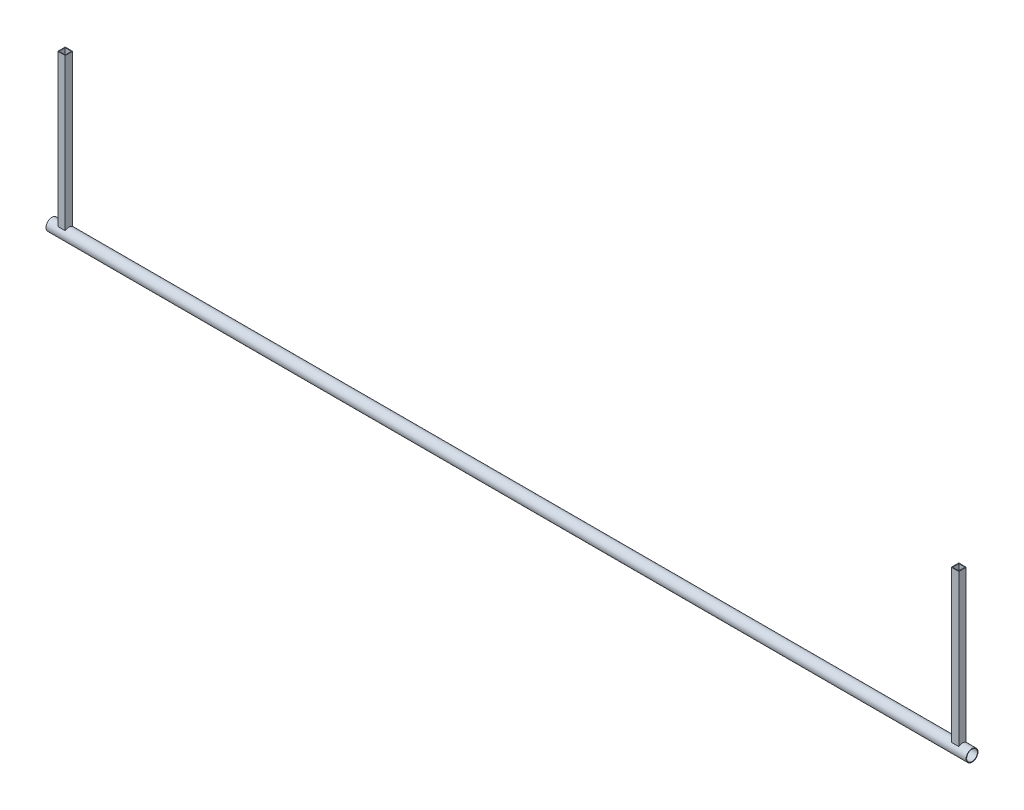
ISO-10303-21;
HEADER;
FILE_DESCRIPTION(('STEP AP214'),'2;1');
FILE_NAME('part.step','',(''),(''),'','','');
FILE_SCHEMA(('AUTOMOTIVE_DESIGN { 1 0 10303 214 1 1 1 1 }'));
ENDSEC;
DATA;
#1=APPLICATION_CONTEXT('core data for automotive mechanical design processes');
#2=APPLICATION_PROTOCOL_DEFINITION('international standard','automotive_design',2000,#1);
#3=PRODUCT_CONTEXT('',#1,'mechanical');
#4=PRODUCT('Part','Part','',(#3));
#5=PRODUCT_RELATED_PRODUCT_CATEGORY('part','',(#4));
#6=PRODUCT_DEFINITION_FORMATION('','',#4);
#7=PRODUCT_DEFINITION_CONTEXT('part definition',#1,'design');
#8=PRODUCT_DEFINITION('design','',#6,#7);
#9=PRODUCT_DEFINITION_SHAPE('','',#8);
#10=(LENGTH_UNIT() NAMED_UNIT(*) SI_UNIT(.MILLI.,.METRE.));
#11=(NAMED_UNIT(*) PLANE_ANGLE_UNIT() SI_UNIT($,.RADIAN.));
#12=(NAMED_UNIT(*) SI_UNIT($,.STERADIAN.) SOLID_ANGLE_UNIT());
#13=UNCERTAINTY_MEASURE_WITH_UNIT(LENGTH_MEASURE(1.E-05),#10,'distance_accuracy_value','');
#14=(GEOMETRIC_REPRESENTATION_CONTEXT(3) GLOBAL_UNCERTAINTY_ASSIGNED_CONTEXT((#13)) GLOBAL_UNIT_ASSIGNED_CONTEXT((#10,
#11,#12)) REPRESENTATION_CONTEXT('',''));
#15=CARTESIAN_POINT('',(0.,0.,0.));
#16=DIRECTION('',(0.,0.,1.));
#17=DIRECTION('',(1.,0.,0.));
#18=AXIS2_PLACEMENT_3D('',#15,#16,#17);
#19=CARTESIAN_POINT('',(3090.,0.,0.));
#20=DIRECTION('',(-1.,0.,0.));
#21=DIRECTION('',(0.,0.,1.));
#22=AXIS2_PLACEMENT_3D('',#19,#20,#21);
#23=CYLINDRICAL_SURFACE('',#22,20.);
#24=CARTESIAN_POINT('',(3090.,0.,0.));
#25=DIRECTION('',(1.,0.,0.));
#26=DIRECTION('',(0.,0.,-1.));
#27=AXIS2_PLACEMENT_3D('',#24,#25,#26);
#28=CIRCLE('',#27,20.);
#29=CARTESIAN_POINT('',(3090.,0.,-20.));
#30=VERTEX_POINT('',#29);
#31=EDGE_CURVE('E241',#30,#30,#28,.T.);
#32=ORIENTED_EDGE('',*,*,#31,.F.);
#33=EDGE_LOOP('',(#32));
#34=FACE_BOUND('',#33,.T.);
#35=CARTESIAN_POINT('',(0.,0.,0.));
#36=DIRECTION('',(1.,0.,0.));
#37=DIRECTION('',(0.,0.,-1.));
#38=AXIS2_PLACEMENT_3D('',#35,#36,#37);
#39=CIRCLE('',#38,20.);
#40=CARTESIAN_POINT('',(0.,0.,-20.));
#41=VERTEX_POINT('',#40);
#42=EDGE_CURVE('E240',#41,#41,#39,.T.);
#43=ORIENTED_EDGE('',*,*,#42,.T.);
#44=EDGE_LOOP('',(#43));
#45=FACE_BOUND('',#44,.T.);
#46=CARTESIAN_POINT('',(32.,0.,0.));
#47=DIRECTION('',(1.,0.,0.));
#48=DIRECTION('',(0.,0.,-1.));
#49=AXIS2_PLACEMENT_3D('',#46,#47,#48);
#50=CIRCLE('',#49,20.);
#51=CARTESIAN_POINT('',(32.,15.612494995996,-12.5));
#52=VERTEX_POINT('',#51);
#53=CARTESIAN_POINT('',(32.,15.6124949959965,12.4999999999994));
#54=VERTEX_POINT('',#53);
#55=EDGE_CURVE('E267',#52,#54,#50,.T.);
#56=ORIENTED_EDGE('',*,*,#55,.F.);
#57=DIRECTION('',(-1.,0.,0.));
#58=VECTOR('',#57,1.);
#59=CARTESIAN_POINT('',(3090.,15.612494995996,-12.5));
#60=LINE('',#59,#58);
#61=CARTESIAN_POINT('',(56.9999999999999,15.612494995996,-12.5));
#62=VERTEX_POINT('',#61);
#63=EDGE_CURVE('E258',#62,#52,#60,.T.);
#64=ORIENTED_EDGE('',*,*,#63,.F.);
#65=CARTESIAN_POINT('',(56.9999999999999,0.,0.));
#66=DIRECTION('',(-1.,0.,0.));
#67=DIRECTION('',(0.,0.,1.));
#68=AXIS2_PLACEMENT_3D('',#65,#66,#67);
#69=CIRCLE('',#68,20.);
#70=CARTESIAN_POINT('',(56.9999999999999,15.612494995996,12.5));
#71=VERTEX_POINT('',#70);
#72=EDGE_CURVE('E261',#71,#62,#69,.T.);
#73=ORIENTED_EDGE('',*,*,#72,.F.);
#74=DIRECTION('',(-1.,0.,0.));
#75=VECTOR('',#74,1.);
#76=CARTESIAN_POINT('',(3090.,15.6124949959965,12.4999999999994));
#77=LINE('',#76,#75);
#78=EDGE_CURVE('E264',#54,#71,#77,.F.);
#79=ORIENTED_EDGE('',*,*,#78,.F.);
#80=EDGE_LOOP('',(#56,#64,#73,#79));
#81=FACE_BOUND('',#80,.T.);
#82=CARTESIAN_POINT('',(3058.,0.,0.));
#83=DIRECTION('',(-1.,0.,0.));
#84=DIRECTION('',(0.,0.,1.));
#85=AXIS2_PLACEMENT_3D('',#82,#83,#84);
#86=CIRCLE('',#85,20.);
#87=CARTESIAN_POINT('',(3058.,15.6124949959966,12.4999999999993));
#88=VERTEX_POINT('',#87);
#89=CARTESIAN_POINT('',(3058.,15.6124949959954,-12.5000000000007));
#90=VERTEX_POINT('',#89);
#91=EDGE_CURVE('E11',#88,#90,#86,.T.);
#92=ORIENTED_EDGE('',*,*,#91,.F.);
#93=DIRECTION('',(-1.,0.,0.));
#94=VECTOR('',#93,1.);
#95=CARTESIAN_POINT('',(3090.,15.6124949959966,12.4999999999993));
#96=LINE('',#95,#94);
#97=CARTESIAN_POINT('',(3033.,15.6124949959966,12.4999999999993));
#98=VERTEX_POINT('',#97);
#99=EDGE_CURVE('E279',#98,#88,#96,.F.);
#100=ORIENTED_EDGE('',*,*,#99,.F.);
#101=CARTESIAN_POINT('',(3033.,0.,0.));
#102=DIRECTION('',(1.,0.,0.));
#103=DIRECTION('',(0.,0.,-1.));
#104=AXIS2_PLACEMENT_3D('',#101,#102,#103);
#105=CIRCLE('',#104,20.);
#106=CARTESIAN_POINT('',(3033.,15.6124949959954,-12.5000000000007));
#107=VERTEX_POINT('',#106);
#108=EDGE_CURVE('E50',#107,#98,#105,.T.);
#109=ORIENTED_EDGE('',*,*,#108,.F.);
#110=DIRECTION('',(-1.,0.,0.));
#111=VECTOR('',#110,1.);
#112=CARTESIAN_POINT('',(3090.,15.6124949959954,-12.5000000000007));
#113=LINE('',#112,#111);
#114=EDGE_CURVE('E40',#90,#107,#113,.T.);
#115=ORIENTED_EDGE('',*,*,#114,.F.);
#116=EDGE_LOOP('',(#92,#100,#109,#115));
#117=FACE_BOUND('',#116,.T.);
#118=ADVANCED_FACE('F32',(#34,#45,#81,#117),#23,.T.);
#119=CARTESIAN_POINT('',(3090.,0.,0.));
#120=DIRECTION('',(1.,0.,0.));
#121=DIRECTION('',(0.,0.,-1.));
#122=AXIS2_PLACEMENT_3D('',#119,#120,#121);
#123=PLANE('',#122);
#124=CARTESIAN_POINT('',(3090.,0.,0.));
#125=DIRECTION('',(-1.,0.,0.));
#126=DIRECTION('',(0.,0.,1.));
#127=AXIS2_PLACEMENT_3D('',#124,#125,#126);
#128=CIRCLE('',#127,18.);
#129=CARTESIAN_POINT('',(3090.,0.,18.));
#130=VERTEX_POINT('',#129);
#131=EDGE_CURVE('E153',#130,#130,#128,.T.);
#132=ORIENTED_EDGE('',*,*,#131,.T.);
#133=EDGE_LOOP('',(#132));
#134=FACE_BOUND('',#133,.T.);
#135=ORIENTED_EDGE('',*,*,#31,.T.);
#136=EDGE_LOOP('',(#135));
#137=FACE_BOUND('',#136,.T.);
#138=ADVANCED_FACE('F308',(#134,#137),#123,.T.);
#139=CARTESIAN_POINT('',(0.,0.,0.));
#140=DIRECTION('',(1.,0.,0.));
#141=DIRECTION('',(0.,0.,-1.));
#142=AXIS2_PLACEMENT_3D('',#139,#140,#141);
#143=PLANE('',#142);
#144=CARTESIAN_POINT('',(0.,0.,0.));
#145=DIRECTION('',(-1.,0.,0.));
#146=DIRECTION('',(0.,0.,1.));
#147=AXIS2_PLACEMENT_3D('',#144,#145,#146);
#148=CIRCLE('',#147,18.);
#149=CARTESIAN_POINT('',(0.,0.,18.));
#150=VERTEX_POINT('',#149);
#151=EDGE_CURVE('E381',#150,#150,#148,.T.);
#152=ORIENTED_EDGE('',*,*,#151,.F.);
#153=EDGE_LOOP('',(#152));
#154=FACE_BOUND('',#153,.T.);
#155=ORIENTED_EDGE('',*,*,#42,.F.);
#156=EDGE_LOOP('',(#155));
#157=FACE_BOUND('',#156,.T.);
#158=ADVANCED_FACE('F314',(#154,#157),#143,.F.);
#159=CARTESIAN_POINT('',(32.,525.,12.5));
#160=DIRECTION('',(1.,0.,0.));
#161=DIRECTION('',(0.,0.,-1.));
#162=AXIS2_PLACEMENT_3D('',#159,#160,#161);
#163=PLANE('',#162);
#164=DIRECTION('',(0.,-1.,0.));
#165=VECTOR('',#164,1.);
#166=CARTESIAN_POINT('',(32.,525.,-12.5));
#167=LINE('',#166,#165);
#168=CARTESIAN_POINT('',(32.,525.,-12.5));
#169=VERTEX_POINT('',#168);
#170=EDGE_CURVE('E228',#169,#52,#167,.T.);
#171=ORIENTED_EDGE('',*,*,#170,.T.);
#172=ORIENTED_EDGE('',*,*,#55,.T.);
#173=DIRECTION('',(0.,-1.,0.));
#174=VECTOR('',#173,1.);
#175=CARTESIAN_POINT('',(32.,525.,12.5));
#176=LINE('',#175,#174);
#177=CARTESIAN_POINT('',(32.,525.,12.5));
#178=VERTEX_POINT('',#177);
#179=EDGE_CURVE('E237',#178,#54,#176,.T.);
#180=ORIENTED_EDGE('',*,*,#179,.F.);
#181=DIRECTION('',(0.,0.,1.));
#182=VECTOR('',#181,1.);
#183=CARTESIAN_POINT('',(32.,525.,12.5));
#184=LINE('',#183,#182);
#185=EDGE_CURVE('E219',#169,#178,#184,.T.);
#186=ORIENTED_EDGE('',*,*,#185,.F.);
#187=EDGE_LOOP('',(#171,#172,#180,#186));
#188=FACE_BOUND('',#187,.T.);
#189=ADVANCED_FACE('F370',(#188),#163,.F.);
#190=CARTESIAN_POINT('',(32.,525.,12.5));
#191=DIRECTION('',(0.,0.,-1.));
#192=DIRECTION('',(-1.,0.,0.));
#193=AXIS2_PLACEMENT_3D('',#190,#191,#192);
#194=PLANE('',#193);
#195=ORIENTED_EDGE('',*,*,#179,.T.);
#196=ORIENTED_EDGE('',*,*,#78,.T.);
#197=DIRECTION('',(0.,-1.,0.));
#198=VECTOR('',#197,1.);
#199=CARTESIAN_POINT('',(57.,525.,12.5));
#200=LINE('',#199,#198);
#201=CARTESIAN_POINT('',(57.,525.,12.5));
#202=VERTEX_POINT('',#201);
#203=EDGE_CURVE('E234',#202,#71,#200,.T.);
#204=ORIENTED_EDGE('',*,*,#203,.F.);
#205=DIRECTION('',(1.,0.,0.));
#206=VECTOR('',#205,1.);
#207=CARTESIAN_POINT('',(32.,525.,12.5));
#208=LINE('',#207,#206);
#209=EDGE_CURVE('E222',#178,#202,#208,.T.);
#210=ORIENTED_EDGE('',*,*,#209,.F.);
#211=EDGE_LOOP('',(#195,#196,#204,#210));
#212=FACE_BOUND('',#211,.T.);
#213=ADVANCED_FACE('F366',(#212),#194,.F.);
#214=CARTESIAN_POINT('',(57.,525.,12.5));
#215=DIRECTION('',(-1.,0.,0.));
#216=DIRECTION('',(0.,0.,1.));
#217=AXIS2_PLACEMENT_3D('',#214,#215,#216);
#218=PLANE('',#217);
#219=ORIENTED_EDGE('',*,*,#203,.T.);
#220=ORIENTED_EDGE('',*,*,#72,.T.);
#221=DIRECTION('',(0.,-1.,0.));
#222=VECTOR('',#221,1.);
#223=CARTESIAN_POINT('',(57.,525.,-12.5));
#224=LINE('',#223,#222);
#225=CARTESIAN_POINT('',(57.,525.,-12.5));
#226=VERTEX_POINT('',#225);
#227=EDGE_CURVE('E231',#226,#62,#224,.T.);
#228=ORIENTED_EDGE('',*,*,#227,.F.);
#229=DIRECTION('',(0.,0.,-1.));
#230=VECTOR('',#229,1.);
#231=CARTESIAN_POINT('',(57.,525.,12.5));
#232=LINE('',#231,#230);
#233=EDGE_CURVE('E224',#202,#226,#232,.T.);
#234=ORIENTED_EDGE('',*,*,#233,.F.);
#235=EDGE_LOOP('',(#219,#220,#228,#234));
#236=FACE_BOUND('',#235,.T.);
#237=ADVANCED_FACE('F362',(#236),#218,.F.);
#238=CARTESIAN_POINT('',(32.,525.,-12.5));
#239=DIRECTION('',(0.,0.,1.));
#240=DIRECTION('',(1.,0.,0.));
#241=AXIS2_PLACEMENT_3D('',#238,#239,#240);
#242=PLANE('',#241);
#243=ORIENTED_EDGE('',*,*,#227,.T.);
#244=ORIENTED_EDGE('',*,*,#63,.T.);
#245=ORIENTED_EDGE('',*,*,#170,.F.);
#246=DIRECTION('',(-1.,0.,0.));
#247=VECTOR('',#246,1.);
#248=CARTESIAN_POINT('',(32.,525.,-12.5));
#249=LINE('',#248,#247);
#250=EDGE_CURVE('E226',#226,#169,#249,.T.);
#251=ORIENTED_EDGE('',*,*,#250,.F.);
#252=EDGE_LOOP('',(#243,#244,#245,#251));
#253=FACE_BOUND('',#252,.T.);
#254=ADVANCED_FACE('F356',(#253),#242,.F.);
#255=CARTESIAN_POINT('',(34.,525.,10.4999999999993));
#256=DIRECTION('',(1.,0.,0.));
#257=DIRECTION('',(0.,0.,-1.));
#258=AXIS2_PLACEMENT_3D('',#255,#256,#257);
#259=PLANE('',#258);
#260=CARTESIAN_POINT('',(33.9999999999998,0.,0.));
#261=DIRECTION('',(1.,0.,0.));
#262=DIRECTION('',(0.,0.,-1.));
#263=AXIS2_PLACEMENT_3D('',#260,#261,#262);
#264=CIRCLE('',#263,20.);
#265=CARTESIAN_POINT('',(34.0000000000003,17.0220445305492,-10.5));
#266=VERTEX_POINT('',#265);
#267=CARTESIAN_POINT('',(34.,17.0220445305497,10.4999999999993));
#268=VERTEX_POINT('',#267);
#269=EDGE_CURVE('E255',#266,#268,#264,.T.);
#270=ORIENTED_EDGE('',*,*,#269,.F.);
#271=DIRECTION('',(0.,-1.,0.));
#272=VECTOR('',#271,1.);
#273=CARTESIAN_POINT('',(34.,525.,-10.5));
#274=LINE('',#273,#272);
#275=CARTESIAN_POINT('',(34.,525.,-10.5));
#276=VERTEX_POINT('',#275);
#277=EDGE_CURVE('E208',#276,#266,#274,.T.);
#278=ORIENTED_EDGE('',*,*,#277,.F.);
#279=DIRECTION('',(0.,0.,1.));
#280=VECTOR('',#279,1.);
#281=CARTESIAN_POINT('',(34.,525.,10.4999999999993));
#282=LINE('',#281,#280);
#283=CARTESIAN_POINT('',(34.,525.,10.4999999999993));
#284=VERTEX_POINT('',#283);
#285=EDGE_CURVE('E199',#276,#284,#282,.T.);
#286=ORIENTED_EDGE('',*,*,#285,.T.);
#287=DIRECTION('',(0.,-1.,0.));
#288=VECTOR('',#287,1.);
#289=CARTESIAN_POINT('',(34.,525.,10.4999999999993));
#290=LINE('',#289,#288);
#291=EDGE_CURVE('E216',#284,#268,#290,.T.);
#292=ORIENTED_EDGE('',*,*,#291,.T.);
#293=EDGE_LOOP('',(#270,#278,#286,#292));
#294=FACE_BOUND('',#293,.T.);
#295=ADVANCED_FACE('F345',(#294),#259,.T.);
#296=CARTESIAN_POINT('',(34.,525.,10.4999999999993));
#297=DIRECTION('',(0.,0.,-1.));
#298=DIRECTION('',(-1.,0.,0.));
#299=AXIS2_PLACEMENT_3D('',#296,#297,#298);
#300=PLANE('',#299);
#301=DIRECTION('',(-1.,0.,0.));
#302=VECTOR('',#301,1.);
#303=CARTESIAN_POINT('',(3090.,17.0220445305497,10.4999999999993));
#304=LINE('',#303,#302);
#305=CARTESIAN_POINT('',(55.0000000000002,17.0220445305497,10.4999999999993));
#306=VERTEX_POINT('',#305);
#307=EDGE_CURVE('E252',#268,#306,#304,.F.);
#308=ORIENTED_EDGE('',*,*,#307,.F.);
#309=ORIENTED_EDGE('',*,*,#291,.F.);
#310=DIRECTION('',(1.,0.,0.));
#311=VECTOR('',#310,1.);
#312=CARTESIAN_POINT('',(34.,525.,10.4999999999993));
#313=LINE('',#312,#311);
#314=CARTESIAN_POINT('',(55.,525.,10.4999999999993));
#315=VERTEX_POINT('',#314);
#316=EDGE_CURVE('E201',#284,#315,#313,.T.);
#317=ORIENTED_EDGE('',*,*,#316,.T.);
#318=DIRECTION('',(0.,-1.,0.));
#319=VECTOR('',#318,1.);
#320=CARTESIAN_POINT('',(55.,525.,10.4999999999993));
#321=LINE('',#320,#319);
#322=EDGE_CURVE('E213',#315,#306,#321,.T.);
#323=ORIENTED_EDGE('',*,*,#322,.T.);
#324=EDGE_LOOP('',(#308,#309,#317,#323));
#325=FACE_BOUND('',#324,.T.);
#326=ADVANCED_FACE('F348',(#325),#300,.T.);
#327=CARTESIAN_POINT('',(55.,525.,10.4999999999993));
#328=DIRECTION('',(-1.,0.,0.));
#329=DIRECTION('',(0.,0.,1.));
#330=AXIS2_PLACEMENT_3D('',#327,#328,#329);
#331=PLANE('',#330);
#332=CARTESIAN_POINT('',(55.0000000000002,0.,0.));
#333=DIRECTION('',(-1.,0.,0.));
#334=DIRECTION('',(0.,0.,1.));
#335=AXIS2_PLACEMENT_3D('',#332,#333,#334);
#336=CIRCLE('',#335,20.);
#337=CARTESIAN_POINT('',(55.,17.0220445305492,-10.5));
#338=VERTEX_POINT('',#337);
#339=EDGE_CURVE('E249',#306,#338,#336,.T.);
#340=ORIENTED_EDGE('',*,*,#339,.F.);
#341=ORIENTED_EDGE('',*,*,#322,.F.);
#342=DIRECTION('',(0.,0.,-1.));
#343=VECTOR('',#342,1.);
#344=CARTESIAN_POINT('',(55.,525.,10.4999999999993));
#345=LINE('',#344,#343);
#346=CARTESIAN_POINT('',(55.,525.,-10.5));
#347=VERTEX_POINT('',#346);
#348=EDGE_CURVE('E203',#315,#347,#345,.T.);
#349=ORIENTED_EDGE('',*,*,#348,.T.);
#350=DIRECTION('',(0.,-1.,0.));
#351=VECTOR('',#350,1.);
#352=CARTESIAN_POINT('',(55.,525.,-10.5));
#353=LINE('',#352,#351);
#354=EDGE_CURVE('E210',#347,#338,#353,.T.);
#355=ORIENTED_EDGE('',*,*,#354,.T.);
#356=EDGE_LOOP('',(#340,#341,#349,#355));
#357=FACE_BOUND('',#356,.T.);
#358=ADVANCED_FACE('F337',(#357),#331,.T.);
#359=CARTESIAN_POINT('',(34.,525.,-10.5));
#360=DIRECTION('',(0.,0.,1.));
#361=DIRECTION('',(1.,0.,0.));
#362=AXIS2_PLACEMENT_3D('',#359,#360,#361);
#363=PLANE('',#362);
#364=DIRECTION('',(-1.,0.,0.));
#365=VECTOR('',#364,1.);
#366=CARTESIAN_POINT('',(3090.,17.0220445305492,-10.5));
#367=LINE('',#366,#365);
#368=EDGE_CURVE('E244',#338,#266,#367,.T.);
#369=ORIENTED_EDGE('',*,*,#368,.F.);
#370=ORIENTED_EDGE('',*,*,#354,.F.);
#371=DIRECTION('',(-1.,0.,0.));
#372=VECTOR('',#371,1.);
#373=CARTESIAN_POINT('',(34.,525.,-10.5));
#374=LINE('',#373,#372);
#375=EDGE_CURVE('E206',#347,#276,#374,.T.);
#376=ORIENTED_EDGE('',*,*,#375,.T.);
#377=ORIENTED_EDGE('',*,*,#277,.T.);
#378=EDGE_LOOP('',(#369,#370,#376,#377));
#379=FACE_BOUND('',#378,.T.);
#380=ADVANCED_FACE('F330',(#379),#363,.T.);
#381=CARTESIAN_POINT('',(0.,525.,0.));
#382=DIRECTION('',(0.,-1.,0.));
#383=DIRECTION('',(0.,0.,-1.));
#384=AXIS2_PLACEMENT_3D('',#381,#382,#383);
#385=PLANE('',#384);
#386=ORIENTED_EDGE('',*,*,#185,.T.);
#387=ORIENTED_EDGE('',*,*,#209,.T.);
#388=ORIENTED_EDGE('',*,*,#233,.T.);
#389=ORIENTED_EDGE('',*,*,#250,.T.);
#390=EDGE_LOOP('',(#386,#387,#388,#389));
#391=FACE_BOUND('',#390,.T.);
#392=ORIENTED_EDGE('',*,*,#285,.F.);
#393=ORIENTED_EDGE('',*,*,#375,.F.);
#394=ORIENTED_EDGE('',*,*,#348,.F.);
#395=ORIENTED_EDGE('',*,*,#316,.F.);
#396=EDGE_LOOP('',(#392,#393,#394,#395));
#397=FACE_BOUND('',#396,.T.);
#398=ADVANCED_FACE('F323',(#391,#397),#385,.F.);
#399=ORIENTED_EDGE('',*,*,#368,.T.);
#400=ORIENTED_EDGE('',*,*,#269,.T.);
#401=ORIENTED_EDGE('',*,*,#307,.T.);
#402=ORIENTED_EDGE('',*,*,#339,.T.);
#403=EDGE_LOOP('',(#399,#400,#401,#402));
#404=FACE_BOUND('',#403,.T.);
#405=ADVANCED_FACE('F34',(#404),#23,.T.);
#406=CARTESIAN_POINT('',(3058.,525.,12.4999999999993));
#407=DIRECTION('',(-1.,0.,0.));
#408=DIRECTION('',(0.,0.,1.));
#409=AXIS2_PLACEMENT_3D('',#406,#407,#408);
#410=PLANE('',#409);
#411=DIRECTION('',(0.,-1.,0.));
#412=VECTOR('',#411,1.);
#413=CARTESIAN_POINT('',(3058.,525.,12.4999999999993));
#414=LINE('',#413,#412);
#415=CARTESIAN_POINT('',(3058.,525.,12.4999999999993));
#416=VERTEX_POINT('',#415);
#417=EDGE_CURVE('E187',#416,#88,#414,.T.);
#418=ORIENTED_EDGE('',*,*,#417,.T.);
#419=ORIENTED_EDGE('',*,*,#91,.T.);
#420=DIRECTION('',(0.,-1.,0.));
#421=VECTOR('',#420,1.);
#422=CARTESIAN_POINT('',(3058.,525.,-12.5000000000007));
#423=LINE('',#422,#421);
#424=CARTESIAN_POINT('',(3058.,525.,-12.5000000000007));
#425=VERTEX_POINT('',#424);
#426=EDGE_CURVE('E196',#425,#90,#423,.T.);
#427=ORIENTED_EDGE('',*,*,#426,.F.);
#428=DIRECTION('',(0.,0.,-1.));
#429=VECTOR('',#428,1.);
#430=CARTESIAN_POINT('',(3058.,525.,12.4999999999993));
#431=LINE('',#430,#429);
#432=EDGE_CURVE('E161',#416,#425,#431,.T.);
#433=ORIENTED_EDGE('',*,*,#432,.F.);
#434=EDGE_LOOP('',(#418,#419,#427,#433));
#435=FACE_BOUND('',#434,.T.);
#436=ADVANCED_FACE('F295',(#435),#410,.F.);
#437=CARTESIAN_POINT('',(3058.,525.,-12.5000000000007));
#438=DIRECTION('',(0.,0.,1.));
#439=DIRECTION('',(1.,0.,0.));
#440=AXIS2_PLACEMENT_3D('',#437,#438,#439);
#441=PLANE('',#440);
#442=ORIENTED_EDGE('',*,*,#426,.T.);
#443=ORIENTED_EDGE('',*,*,#114,.T.);
#444=DIRECTION('',(0.,-1.,0.));
#445=VECTOR('',#444,1.);
#446=CARTESIAN_POINT('',(3033.,525.,-12.5000000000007));
#447=LINE('',#446,#445);
#448=CARTESIAN_POINT('',(3033.,525.,-12.5000000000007));
#449=VERTEX_POINT('',#448);
#450=EDGE_CURVE('E193',#449,#107,#447,.T.);
#451=ORIENTED_EDGE('',*,*,#450,.F.);
#452=DIRECTION('',(-1.,0.,0.));
#453=VECTOR('',#452,1.);
#454=CARTESIAN_POINT('',(3058.,525.,-12.5000000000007));
#455=LINE('',#454,#453);
#456=EDGE_CURVE('E181',#425,#449,#455,.T.);
#457=ORIENTED_EDGE('',*,*,#456,.F.);
#458=EDGE_LOOP('',(#442,#443,#451,#457));
#459=FACE_BOUND('',#458,.T.);
#460=ADVANCED_FACE('F284',(#459),#441,.F.);
#461=CARTESIAN_POINT('',(3033.,525.,12.4999999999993));
#462=DIRECTION('',(1.,0.,0.));
#463=DIRECTION('',(0.,0.,-1.));
#464=AXIS2_PLACEMENT_3D('',#461,#462,#463);
#465=PLANE('',#464);
#466=ORIENTED_EDGE('',*,*,#450,.T.);
#467=ORIENTED_EDGE('',*,*,#108,.T.);
#468=DIRECTION('',(0.,-1.,0.));
#469=VECTOR('',#468,1.);
#470=CARTESIAN_POINT('',(3033.,525.,12.4999999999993));
#471=LINE('',#470,#469);
#472=CARTESIAN_POINT('',(3033.,525.,12.4999999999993));
#473=VERTEX_POINT('',#472);
#474=EDGE_CURVE('E190',#473,#98,#471,.T.);
#475=ORIENTED_EDGE('',*,*,#474,.F.);
#476=DIRECTION('',(0.,0.,1.));
#477=VECTOR('',#476,1.);
#478=CARTESIAN_POINT('',(3033.,525.,12.4999999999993));
#479=LINE('',#478,#477);
#480=EDGE_CURVE('E183',#449,#473,#479,.T.);
#481=ORIENTED_EDGE('',*,*,#480,.F.);
#482=EDGE_LOOP('',(#466,#467,#475,#481));
#483=FACE_BOUND('',#482,.T.);
#484=ADVANCED_FACE('F288',(#483),#465,.F.);
#485=CARTESIAN_POINT('',(3058.,525.,12.4999999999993));
#486=DIRECTION('',(0.,0.,-1.));
#487=DIRECTION('',(-1.,0.,0.));
#488=AXIS2_PLACEMENT_3D('',#485,#486,#487);
#489=PLANE('',#488);
#490=ORIENTED_EDGE('',*,*,#474,.T.);
#491=ORIENTED_EDGE('',*,*,#99,.T.);
#492=ORIENTED_EDGE('',*,*,#417,.F.);
#493=DIRECTION('',(1.,0.,0.));
#494=VECTOR('',#493,1.);
#495=CARTESIAN_POINT('',(3058.,525.,12.4999999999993));
#496=LINE('',#495,#494);
#497=EDGE_CURVE('E185',#473,#416,#496,.T.);
#498=ORIENTED_EDGE('',*,*,#497,.F.);
#499=EDGE_LOOP('',(#490,#491,#492,#498));
#500=FACE_BOUND('',#499,.T.);
#501=ADVANCED_FACE('F297',(#500),#489,.F.);
#502=CARTESIAN_POINT('',(3035.,525.,10.4999999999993));
#503=DIRECTION('',(1.,0.,0.));
#504=DIRECTION('',(0.,0.,-1.));
#505=AXIS2_PLACEMENT_3D('',#502,#503,#504);
#506=PLANE('',#505);
#507=CARTESIAN_POINT('',(3035.,0.,0.));
#508=DIRECTION('',(1.,0.,0.));
#509=DIRECTION('',(0.,0.,-1.));
#510=AXIS2_PLACEMENT_3D('',#507,#508,#509);
#511=CIRCLE('',#510,20.);
#512=CARTESIAN_POINT('',(3035.,17.0220445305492,-10.5));
#513=VERTEX_POINT('',#512);
#514=CARTESIAN_POINT('',(3035.,17.0220445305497,10.4999999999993));
#515=VERTEX_POINT('',#514);
#516=EDGE_CURVE('E277',#513,#515,#511,.T.);
#517=ORIENTED_EDGE('',*,*,#516,.F.);
#518=DIRECTION('',(0.,-1.,0.));
#519=VECTOR('',#518,1.);
#520=CARTESIAN_POINT('',(3035.,525.,-10.5));
#521=LINE('',#520,#519);
#522=CARTESIAN_POINT('',(3035.,525.,-10.5));
#523=VERTEX_POINT('',#522);
#524=EDGE_CURVE('E148',#523,#513,#521,.T.);
#525=ORIENTED_EDGE('',*,*,#524,.F.);
#526=DIRECTION('',(0.,0.,1.));
#527=VECTOR('',#526,1.);
#528=CARTESIAN_POINT('',(3035.,525.,10.4999999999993));
#529=LINE('',#528,#527);
#530=CARTESIAN_POINT('',(3035.,525.,10.4999999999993));
#531=VERTEX_POINT('',#530);
#532=EDGE_CURVE('E142',#523,#531,#529,.T.);
#533=ORIENTED_EDGE('',*,*,#532,.T.);
#534=DIRECTION('',(0.,-1.,0.));
#535=VECTOR('',#534,1.);
#536=CARTESIAN_POINT('',(3035.,525.,10.4999999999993));
#537=LINE('',#536,#535);
#538=EDGE_CURVE('E146',#531,#515,#537,.T.);
#539=ORIENTED_EDGE('',*,*,#538,.T.);
#540=EDGE_LOOP('',(#517,#525,#533,#539));
#541=FACE_BOUND('',#540,.T.);
#542=ADVANCED_FACE('F145',(#541),#506,.T.);
#543=CARTESIAN_POINT('',(3035.,525.,10.4999999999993));
#544=DIRECTION('',(0.,0.,-1.));
#545=DIRECTION('',(-1.,0.,0.));
#546=AXIS2_PLACEMENT_3D('',#543,#544,#545);
#547=PLANE('',#546);
#548=DIRECTION('',(-1.,0.,0.));
#549=VECTOR('',#548,1.);
#550=CARTESIAN_POINT('',(3090.,17.0220445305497,10.4999999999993));
#551=LINE('',#550,#549);
#552=CARTESIAN_POINT('',(3056.,17.0220445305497,10.4999999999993));
#553=VERTEX_POINT('',#552);
#554=EDGE_CURVE('E160',#515,#553,#551,.F.);
#555=ORIENTED_EDGE('',*,*,#554,.F.);
#556=ORIENTED_EDGE('',*,*,#538,.F.);
#557=DIRECTION('',(1.,0.,0.));
#558=VECTOR('',#557,1.);
#559=CARTESIAN_POINT('',(3035.,525.,10.4999999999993));
#560=LINE('',#559,#558);
#561=CARTESIAN_POINT('',(3056.,525.,10.4999999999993));
#562=VERTEX_POINT('',#561);
#563=EDGE_CURVE('E152',#531,#562,#560,.T.);
#564=ORIENTED_EDGE('',*,*,#563,.T.);
#565=DIRECTION('',(0.,-1.,0.));
#566=VECTOR('',#565,1.);
#567=CARTESIAN_POINT('',(3056.,525.,10.4999999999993));
#568=LINE('',#567,#566);
#569=EDGE_CURVE('E162',#562,#553,#568,.T.);
#570=ORIENTED_EDGE('',*,*,#569,.T.);
#571=EDGE_LOOP('',(#555,#556,#564,#570));
#572=FACE_BOUND('',#571,.T.);
#573=ADVANCED_FACE('F156',(#572),#547,.T.);
#574=CARTESIAN_POINT('',(3056.,525.,10.4999999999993));
#575=DIRECTION('',(-1.,0.,0.));
#576=DIRECTION('',(0.,0.,1.));
#577=AXIS2_PLACEMENT_3D('',#574,#575,#576);
#578=PLANE('',#577);
#579=CARTESIAN_POINT('',(3056.,0.,0.));
#580=DIRECTION('',(-1.,0.,0.));
#581=DIRECTION('',(0.,0.,1.));
#582=AXIS2_PLACEMENT_3D('',#579,#580,#581);
#583=CIRCLE('',#582,20.);
#584=CARTESIAN_POINT('',(3056.,17.0220445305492,-10.5));
#585=VERTEX_POINT('',#584);
#586=EDGE_CURVE('E273',#553,#585,#583,.T.);
#587=ORIENTED_EDGE('',*,*,#586,.F.);
#588=ORIENTED_EDGE('',*,*,#569,.F.);
#589=DIRECTION('',(0.,0.,-1.));
#590=VECTOR('',#589,1.);
#591=CARTESIAN_POINT('',(3056.,525.,10.4999999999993));
#592=LINE('',#591,#590);
#593=CARTESIAN_POINT('',(3056.,525.,-10.5));
#594=VERTEX_POINT('',#593);
#595=EDGE_CURVE('E167',#562,#594,#592,.T.);
#596=ORIENTED_EDGE('',*,*,#595,.T.);
#597=DIRECTION('',(0.,-1.,0.));
#598=VECTOR('',#597,1.);
#599=CARTESIAN_POINT('',(3056.,525.,-10.5));
#600=LINE('',#599,#598);
#601=EDGE_CURVE('E175',#594,#585,#600,.T.);
#602=ORIENTED_EDGE('',*,*,#601,.T.);
#603=EDGE_LOOP('',(#587,#588,#596,#602));
#604=FACE_BOUND('',#603,.T.);
#605=ADVANCED_FACE('F405',(#604),#578,.T.);
#606=CARTESIAN_POINT('',(3035.,525.,-10.5));
#607=DIRECTION('',(0.,0.,1.));
#608=DIRECTION('',(1.,0.,0.));
#609=AXIS2_PLACEMENT_3D('',#606,#607,#608);
#610=PLANE('',#609);
#611=DIRECTION('',(-1.,0.,0.));
#612=VECTOR('',#611,1.);
#613=CARTESIAN_POINT('',(3090.,17.0220445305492,-10.5));
#614=LINE('',#613,#612);
#615=EDGE_CURVE('E270',#585,#513,#614,.T.);
#616=ORIENTED_EDGE('',*,*,#615,.F.);
#617=ORIENTED_EDGE('',*,*,#601,.F.);
#618=DIRECTION('',(-1.,0.,0.));
#619=VECTOR('',#618,1.);
#620=CARTESIAN_POINT('',(3035.,525.,-10.5));
#621=LINE('',#620,#619);
#622=EDGE_CURVE('E169',#594,#523,#621,.T.);
#623=ORIENTED_EDGE('',*,*,#622,.T.);
#624=ORIENTED_EDGE('',*,*,#524,.T.);
#625=EDGE_LOOP('',(#616,#617,#623,#624));
#626=FACE_BOUND('',#625,.T.);
#627=ADVANCED_FACE('F402',(#626),#610,.T.);
#628=CARTESIAN_POINT('',(0.,525.,0.));
#629=DIRECTION('',(0.,1.,0.));
#630=DIRECTION('',(0.,0.,1.));
#631=AXIS2_PLACEMENT_3D('',#628,#629,#630);
#632=PLANE('',#631);
#633=ORIENTED_EDGE('',*,*,#432,.T.);
#634=ORIENTED_EDGE('',*,*,#456,.T.);
#635=ORIENTED_EDGE('',*,*,#480,.T.);
#636=ORIENTED_EDGE('',*,*,#497,.T.);
#637=EDGE_LOOP('',(#633,#634,#635,#636));
#638=FACE_BOUND('',#637,.T.);
#639=ORIENTED_EDGE('',*,*,#563,.F.);
#640=ORIENTED_EDGE('',*,*,#532,.F.);
#641=ORIENTED_EDGE('',*,*,#622,.F.);
#642=ORIENTED_EDGE('',*,*,#595,.F.);
#643=EDGE_LOOP('',(#639,#640,#641,#642));
#644=FACE_BOUND('',#643,.T.);
#645=ADVANCED_FACE('F165',(#638,#644),#632,.T.);
#646=ORIENTED_EDGE('',*,*,#615,.T.);
#647=ORIENTED_EDGE('',*,*,#516,.T.);
#648=ORIENTED_EDGE('',*,*,#554,.T.);
#649=ORIENTED_EDGE('',*,*,#586,.T.);
#650=EDGE_LOOP('',(#646,#647,#648,#649));
#651=FACE_BOUND('',#650,.T.);
#652=ADVANCED_FACE('F310',(#651),#23,.T.);
#653=CARTESIAN_POINT('',(3090.,0.,0.));
#654=DIRECTION('',(-1.,0.,0.));
#655=DIRECTION('',(0.,0.,1.));
#656=AXIS2_PLACEMENT_3D('',#653,#654,#655);
#657=CYLINDRICAL_SURFACE('',#656,18.);
#658=ORIENTED_EDGE('',*,*,#131,.F.);
#659=EDGE_LOOP('',(#658));
#660=FACE_BOUND('',#659,.T.);
#661=ORIENTED_EDGE('',*,*,#151,.T.);
#662=EDGE_LOOP('',(#661));
#663=FACE_BOUND('',#662,.T.);
#664=ADVANCED_FACE('F320',(#660,#663),#657,.F.);
#665=CLOSED_SHELL('',(#118,#138,#158,#189,#213,#237,#254,#295,#326,#358,#380,#398,#405,#436,
#460,#484,#501,#542,#573,#605,#627,#645,#652,#664));
#666=MANIFOLD_SOLID_BREP('B2',#665);
#667=ADVANCED_BREP_SHAPE_REPRESENTATION('',(#18,#666),#14);
#668=SHAPE_DEFINITION_REPRESENTATION(#9,#667);
ENDSEC;
END-ISO-10303-21;
